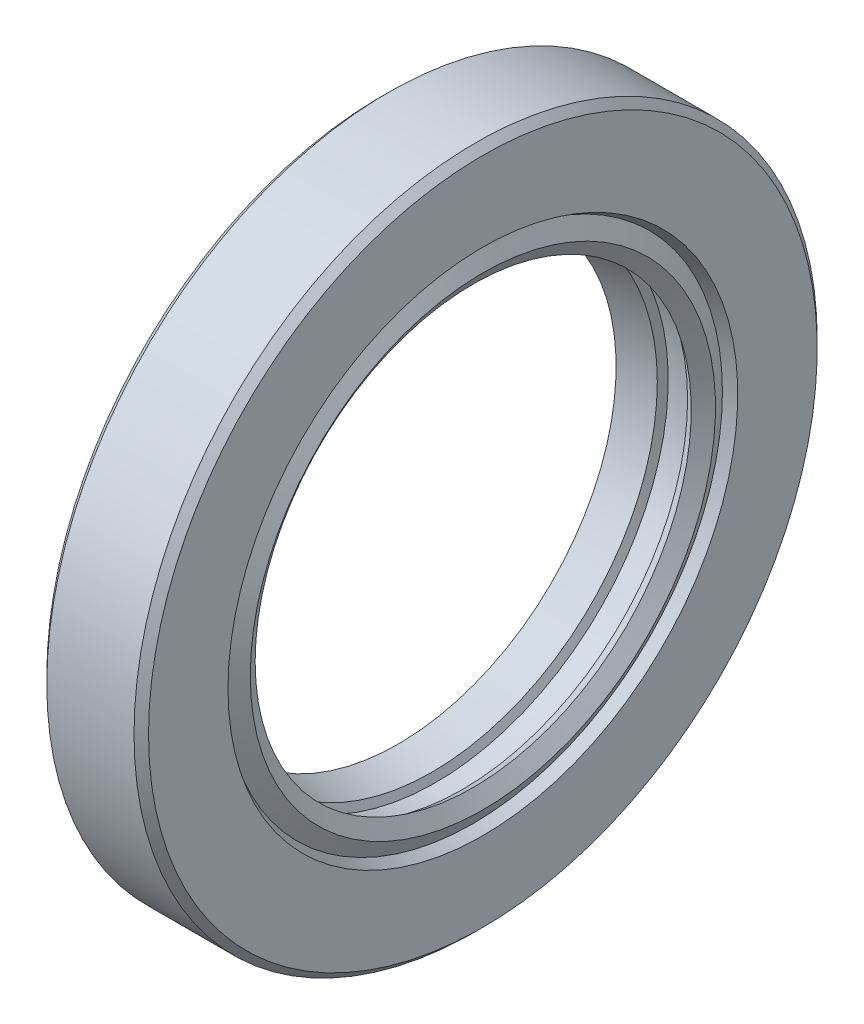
from build123d import *


with BuildPart() as part:
    # Esquisse1 → Base-R_volution (revolve)
    with BuildSketch(Plane.XY, mode=Mode.PRIVATE) as base_r_volution_sk:
        with BuildLine():
            Line((0, 21.5), (4, 21.214285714))
            Line((4, 21.214285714), (4, 17.862428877))
            Line((4, 17.862428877), (2.985778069, 17.66805237))
            ThreePointArc((2.985778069, 17.66805237), (2.176443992, 18.484310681), (1.133974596, 18))
            Line((1.133974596, 18), (0.5, 18))
            Line((0.5, 18), (0.5, 16))
            Line((0.5, 16), (1.166666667, 15))
            Line((1.166666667, 15), (3.5, 15.5))
            Line((3.5, 15.5), (3.75, 16))
            Line((3.75, 16), (5.291666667, 16))
            Line((5.291666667, 16), (5.583333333, 15.5))
            Line((5.583333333, 15.5), (6.333333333, 15))
            Line((6.333333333, 15), (7, 16))
            Line((7, 16), (6.333333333, 17.147448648))
            Line((6.333333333, 17.147448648), (7, 17.534781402))
            Line((7, 17.534781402), (7, 23))
            Line((7, 23), (6.5, 23.5))
            Line((6.5, 23.5), (0.5, 23.5))
            Line((0.5, 23.5), (0, 23))
            Line((0, 23), (0, 21.5))
        make_face()
    revolve(base_r_volution_sk.sketch.rotate(Axis((0, 0, 0), (1, 0, 0)), 90), axis=Axis((0, 0, 0), (1, 0, 0)))


solid = part.part
